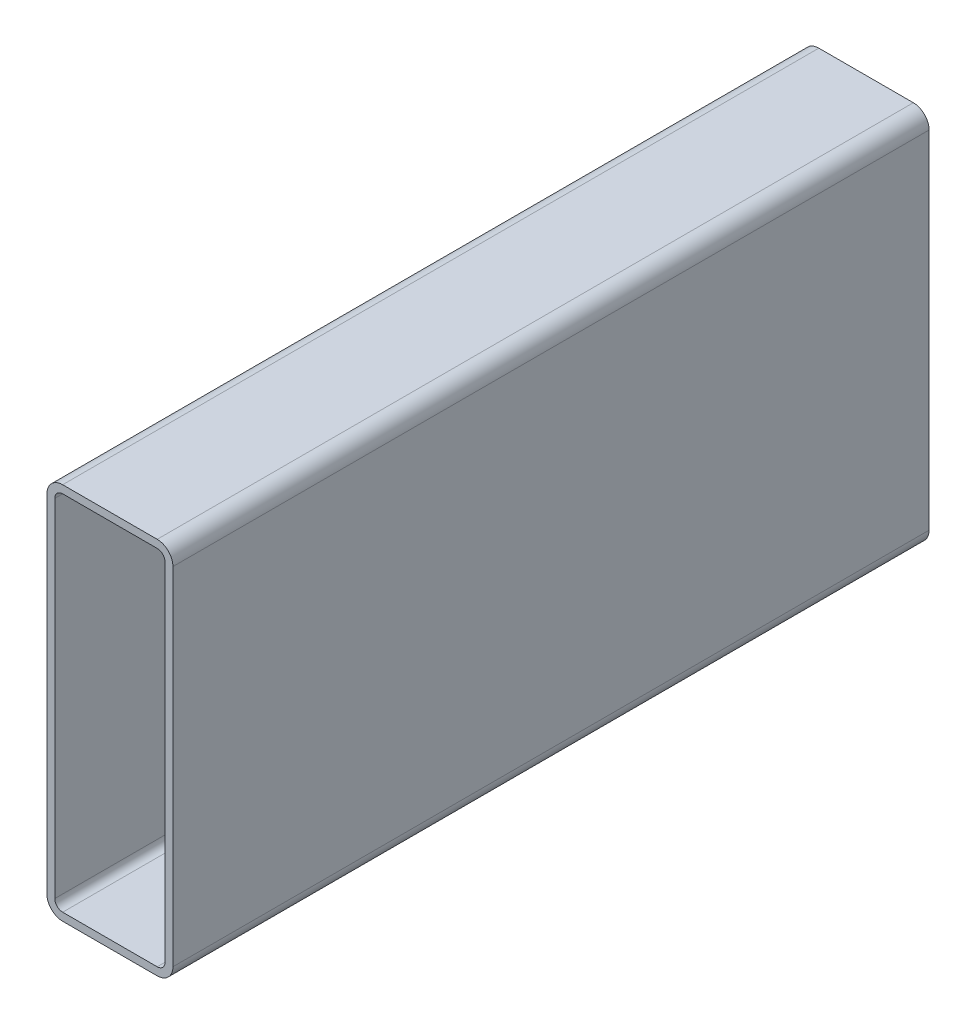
from build123d import *

# Parameters (mm, degrees)
BOSS_EXTRUDE1_DEPTH = 304.8


with BuildPart() as part:
    # Sketch1 → Boss-Extrude1 (new body)
    with BuildSketch(Plane.XY):
        with BuildLine():
            Line((6.35, 152.4), (44.45, 152.4))
            ThreePointArc((44.45, 152.4), (48.940128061, 150.540128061), (50.8, 146.05))
            Line((50.8, 146.05), (50.8, 6.35))
            ThreePointArc((50.8, 6.35), (48.940128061, 1.859871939), (44.45, 0))
            Line((44.45, 0), (6.35, 0))
            ThreePointArc((6.35, 0), (1.859871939, 1.859871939), (0, 6.35))
            Line((0, 6.35), (0, 146.05))
            ThreePointArc((0, 146.05), (1.859871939, 150.540128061), (6.35, 152.4))
        make_face()
        with BuildLine():
            Line((6.35, 149.225), (44.45, 149.225))
            ThreePointArc((44.45, 149.225), (46.69506403, 148.29506403), (47.625, 146.05))
            Line((47.625, 146.05), (47.625, 6.35))
            ThreePointArc((47.625, 6.35), (46.69506403, 4.10493597), (44.45, 3.175))
            Line((44.45, 3.175), (6.35, 3.175))
            ThreePointArc((6.35, 3.175), (4.10493597, 4.10493597), (3.175, 6.35))
            Line((3.175, 6.35), (3.175, 146.05))
            ThreePointArc((3.175, 146.05), (4.10493597, 148.29506403), (6.35, 149.225))
        make_face(mode=Mode.SUBTRACT)
    extrude(amount=BOSS_EXTRUDE1_DEPTH)


solid = part.part
